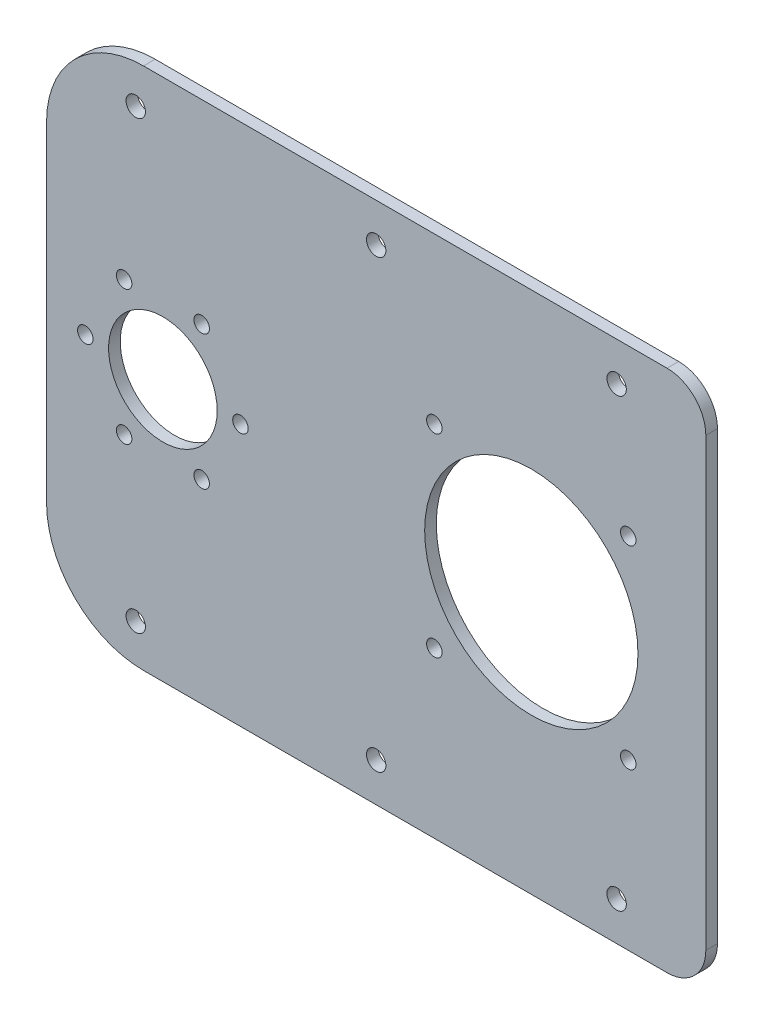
ISO-10303-21;
HEADER;
FILE_DESCRIPTION(('STEP AP214'),'2;1');
FILE_NAME('part.step','',(''),(''),'','','');
FILE_SCHEMA(('AUTOMOTIVE_DESIGN { 1 0 10303 214 1 1 1 1 }'));
ENDSEC;
DATA;
#1=APPLICATION_CONTEXT('core data for automotive mechanical design processes');
#2=APPLICATION_PROTOCOL_DEFINITION('international standard','automotive_design',2000,#1);
#3=PRODUCT_CONTEXT('',#1,'mechanical');
#4=PRODUCT('Part','Part','',(#3));
#5=PRODUCT_RELATED_PRODUCT_CATEGORY('part','',(#4));
#6=PRODUCT_DEFINITION_FORMATION('','',#4);
#7=PRODUCT_DEFINITION_CONTEXT('part definition',#1,'design');
#8=PRODUCT_DEFINITION('design','',#6,#7);
#9=PRODUCT_DEFINITION_SHAPE('','',#8);
#10=(LENGTH_UNIT() NAMED_UNIT(*) SI_UNIT(.MILLI.,.METRE.));
#11=(NAMED_UNIT(*) PLANE_ANGLE_UNIT() SI_UNIT($,.RADIAN.));
#12=(NAMED_UNIT(*) SI_UNIT($,.STERADIAN.) SOLID_ANGLE_UNIT());
#13=UNCERTAINTY_MEASURE_WITH_UNIT(LENGTH_MEASURE(1.E-05),#10,'distance_accuracy_value','');
#14=(GEOMETRIC_REPRESENTATION_CONTEXT(3) GLOBAL_UNCERTAINTY_ASSIGNED_CONTEXT((#13)) GLOBAL_UNIT_ASSIGNED_CONTEXT((#10,
#11,#12)) REPRESENTATION_CONTEXT('',''));
#15=CARTESIAN_POINT('',(0.,0.,0.));
#16=DIRECTION('',(0.,0.,1.));
#17=DIRECTION('',(1.,0.,0.));
#18=AXIS2_PLACEMENT_3D('',#15,#16,#17);
#19=CARTESIAN_POINT('',(0.,0.,1.5));
#20=DIRECTION('',(0.,0.,-1.));
#21=DIRECTION('',(-1.,0.,0.));
#22=AXIS2_PLACEMENT_3D('',#19,#20,#21);
#23=PLANE('',#22);
#24=CARTESIAN_POINT('',(62.,-57.5,1.5));
#25=DIRECTION('',(0.,0.,1.));
#26=DIRECTION('',(-1.,0.,0.));
#27=AXIS2_PLACEMENT_3D('',#24,#25,#26);
#28=CIRCLE('',#27,2.5);
#29=CARTESIAN_POINT('',(59.5,-57.5,1.5));
#30=VERTEX_POINT('',#29);
#31=EDGE_CURVE('E268',#30,#30,#28,.T.);
#32=ORIENTED_EDGE('',*,*,#31,.F.);
#33=EDGE_LOOP('',(#32));
#34=FACE_BOUND('',#33,.T.);
#35=CARTESIAN_POINT('',(-35.,0.,1.5));
#36=DIRECTION('',(0.,0.,1.));
#37=DIRECTION('',(1.,0.,0.));
#38=AXIS2_PLACEMENT_3D('',#35,#36,#37);
#39=CIRCLE('',#38,2.);
#40=CARTESIAN_POINT('',(-33.,0.,1.5));
#41=VERTEX_POINT('',#40);
#42=EDGE_CURVE('E262',#41,#41,#39,.T.);
#43=ORIENTED_EDGE('',*,*,#42,.F.);
#44=EDGE_LOOP('',(#43));
#45=FACE_BOUND('',#44,.T.);
#46=CARTESIAN_POINT('',(-45.,17.3205080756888,1.5));
#47=DIRECTION('',(0.,0.,1.));
#48=DIRECTION('',(1.,0.,0.));
#49=AXIS2_PLACEMENT_3D('',#46,#47,#48);
#50=CIRCLE('',#49,2.);
#51=CARTESIAN_POINT('',(-43.,17.3205080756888,1.5));
#52=VERTEX_POINT('',#51);
#53=EDGE_CURVE('E255',#52,#52,#50,.T.);
#54=ORIENTED_EDGE('',*,*,#53,.F.);
#55=EDGE_LOOP('',(#54));
#56=FACE_BOUND('',#55,.T.);
#57=CARTESIAN_POINT('',(-45.,-17.3205080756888,1.5));
#58=DIRECTION('',(0.,0.,1.));
#59=DIRECTION('',(1.,0.,0.));
#60=AXIS2_PLACEMENT_3D('',#57,#58,#59);
#61=CIRCLE('',#60,2.);
#62=CARTESIAN_POINT('',(-43.,-17.3205080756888,1.5));
#63=VERTEX_POINT('',#62);
#64=EDGE_CURVE('E285',#63,#63,#61,.T.);
#65=ORIENTED_EDGE('',*,*,#64,.F.);
#66=EDGE_LOOP('',(#65));
#67=FACE_BOUND('',#66,.T.);
#68=CARTESIAN_POINT('',(-65.0000000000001,-17.3205080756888,1.5));
#69=DIRECTION('',(0.,0.,1.));
#70=DIRECTION('',(1.,0.,0.));
#71=AXIS2_PLACEMENT_3D('',#68,#69,#70);
#72=CIRCLE('',#71,2.00000000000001);
#73=CARTESIAN_POINT('',(-63.0000000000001,-17.3205080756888,1.5));
#74=VERTEX_POINT('',#73);
#75=EDGE_CURVE('E279',#74,#74,#72,.T.);
#76=ORIENTED_EDGE('',*,*,#75,.F.);
#77=EDGE_LOOP('',(#76));
#78=FACE_BOUND('',#77,.T.);
#79=CARTESIAN_POINT('',(-64.9999999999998,17.3205080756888,1.5));
#80=DIRECTION('',(0.,0.,1.));
#81=DIRECTION('',(1.,0.,0.));
#82=AXIS2_PLACEMENT_3D('',#79,#80,#81);
#83=CIRCLE('',#82,2.);
#84=CARTESIAN_POINT('',(-62.9999999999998,17.3205080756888,1.5));
#85=VERTEX_POINT('',#84);
#86=EDGE_CURVE('E273',#85,#85,#83,.T.);
#87=ORIENTED_EDGE('',*,*,#86,.F.);
#88=EDGE_LOOP('',(#87));
#89=FACE_BOUND('',#88,.T.);
#90=CARTESIAN_POINT('',(0.,-57.5,1.5));
#91=DIRECTION('',(0.,0.,1.));
#92=DIRECTION('',(-1.,0.,0.));
#93=AXIS2_PLACEMENT_3D('',#90,#91,#92);
#94=CIRCLE('',#93,2.5);
#95=CARTESIAN_POINT('',(-2.49999999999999,-57.5,1.5));
#96=VERTEX_POINT('',#95);
#97=EDGE_CURVE('E225',#96,#96,#94,.T.);
#98=ORIENTED_EDGE('',*,*,#97,.F.);
#99=EDGE_LOOP('',(#98));
#100=FACE_BOUND('',#99,.T.);
#101=CARTESIAN_POINT('',(-62.,-57.5,1.5));
#102=DIRECTION('',(0.,0.,1.));
#103=DIRECTION('',(-1.,0.,0.));
#104=AXIS2_PLACEMENT_3D('',#101,#102,#103);
#105=CIRCLE('',#104,2.50000000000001);
#106=CARTESIAN_POINT('',(-64.5,-57.5,1.5));
#107=VERTEX_POINT('',#106);
#108=EDGE_CURVE('E232',#107,#107,#105,.T.);
#109=ORIENTED_EDGE('',*,*,#108,.F.);
#110=EDGE_LOOP('',(#109));
#111=FACE_BOUND('',#110,.T.);
#112=CARTESIAN_POINT('',(-75.,0.,1.5));
#113=DIRECTION('',(0.,0.,1.));
#114=DIRECTION('',(1.,0.,0.));
#115=AXIS2_PLACEMENT_3D('',#112,#113,#114);
#116=CIRCLE('',#115,2.);
#117=CARTESIAN_POINT('',(-73.,0.,1.5));
#118=VERTEX_POINT('',#117);
#119=EDGE_CURVE('E238',#118,#118,#116,.T.);
#120=ORIENTED_EDGE('',*,*,#119,.F.);
#121=EDGE_LOOP('',(#120));
#122=FACE_BOUND('',#121,.T.);
#123=CARTESIAN_POINT('',(-62.,57.5,1.5));
#124=DIRECTION('',(0.,0.,1.));
#125=DIRECTION('',(1.,0.,0.));
#126=AXIS2_PLACEMENT_3D('',#123,#124,#125);
#127=CIRCLE('',#126,2.5);
#128=CARTESIAN_POINT('',(-59.5,57.5,1.5));
#129=VERTEX_POINT('',#128);
#130=EDGE_CURVE('E244',#129,#129,#127,.T.);
#131=ORIENTED_EDGE('',*,*,#130,.F.);
#132=EDGE_LOOP('',(#131));
#133=FACE_BOUND('',#132,.T.);
#134=CARTESIAN_POINT('',(0.,57.5,1.5));
#135=DIRECTION('',(0.,0.,1.));
#136=DIRECTION('',(1.,0.,0.));
#137=AXIS2_PLACEMENT_3D('',#134,#135,#136);
#138=CIRCLE('',#137,2.5);
#139=CARTESIAN_POINT('',(2.5,57.5,1.5));
#140=VERTEX_POINT('',#139);
#141=EDGE_CURVE('E250',#140,#140,#138,.T.);
#142=ORIENTED_EDGE('',*,*,#141,.F.);
#143=EDGE_LOOP('',(#142));
#144=FACE_BOUND('',#143,.T.);
#145=CARTESIAN_POINT('',(62.,57.5,1.5));
#146=DIRECTION('',(0.,0.,1.));
#147=DIRECTION('',(1.,0.,0.));
#148=AXIS2_PLACEMENT_3D('',#145,#146,#147);
#149=CIRCLE('',#148,2.5);
#150=CARTESIAN_POINT('',(64.5,57.5,1.5));
#151=VERTEX_POINT('',#150);
#152=EDGE_CURVE('E219',#151,#151,#149,.T.);
#153=ORIENTED_EDGE('',*,*,#152,.F.);
#154=EDGE_LOOP('',(#153));
#155=FACE_BOUND('',#154,.T.);
#156=CARTESIAN_POINT('',(15.,25.,1.5));
#157=DIRECTION('',(0.,0.,1.));
#158=DIRECTION('',(1.,0.,0.));
#159=AXIS2_PLACEMENT_3D('',#156,#157,#158);
#160=CIRCLE('',#159,2.);
#161=CARTESIAN_POINT('',(17.,25.,1.5));
#162=VERTEX_POINT('',#161);
#163=EDGE_CURVE('E215',#162,#162,#160,.T.);
#164=ORIENTED_EDGE('',*,*,#163,.F.);
#165=EDGE_LOOP('',(#164));
#166=FACE_BOUND('',#165,.T.);
#167=CARTESIAN_POINT('',(65.,25.,1.5));
#168=DIRECTION('',(0.,0.,1.));
#169=DIRECTION('',(1.,0.,0.));
#170=AXIS2_PLACEMENT_3D('',#167,#168,#169);
#171=CIRCLE('',#170,2.);
#172=CARTESIAN_POINT('',(67.,25.,1.5));
#173=VERTEX_POINT('',#172);
#174=EDGE_CURVE('E209',#173,#173,#171,.T.);
#175=ORIENTED_EDGE('',*,*,#174,.F.);
#176=EDGE_LOOP('',(#175));
#177=FACE_BOUND('',#176,.T.);
#178=CARTESIAN_POINT('',(15.,-25.,1.5));
#179=DIRECTION('',(0.,0.,1.));
#180=DIRECTION('',(1.,0.,0.));
#181=AXIS2_PLACEMENT_3D('',#178,#179,#180);
#182=CIRCLE('',#181,2.);
#183=CARTESIAN_POINT('',(17.,-25.,1.5));
#184=VERTEX_POINT('',#183);
#185=EDGE_CURVE('E203',#184,#184,#182,.T.);
#186=ORIENTED_EDGE('',*,*,#185,.F.);
#187=EDGE_LOOP('',(#186));
#188=FACE_BOUND('',#187,.T.);
#189=CARTESIAN_POINT('',(65.,-25.,1.5));
#190=DIRECTION('',(0.,0.,1.));
#191=DIRECTION('',(1.,0.,0.));
#192=AXIS2_PLACEMENT_3D('',#189,#190,#191);
#193=CIRCLE('',#192,2.);
#194=CARTESIAN_POINT('',(67.,-25.,1.5));
#195=VERTEX_POINT('',#194);
#196=EDGE_CURVE('E197',#195,#195,#193,.T.);
#197=ORIENTED_EDGE('',*,*,#196,.F.);
#198=EDGE_LOOP('',(#197));
#199=FACE_BOUND('',#198,.T.);
#200=CARTESIAN_POINT('',(40.,0.,1.5));
#201=DIRECTION('',(0.,0.,1.));
#202=DIRECTION('',(1.,0.,0.));
#203=AXIS2_PLACEMENT_3D('',#200,#201,#202);
#204=CIRCLE('',#203,27.5);
#205=CARTESIAN_POINT('',(67.5,0.,1.5));
#206=VERTEX_POINT('',#205);
#207=EDGE_CURVE('E191',#206,#206,#204,.T.);
#208=ORIENTED_EDGE('',*,*,#207,.F.);
#209=EDGE_LOOP('',(#208));
#210=FACE_BOUND('',#209,.T.);
#211=DIRECTION('',(0.,-1.,0.));
#212=VECTOR('',#211,1.);
#213=CARTESIAN_POINT('',(-85.,-67.5,1.5));
#214=LINE('',#213,#212);
#215=CARTESIAN_POINT('',(-85.,42.5,1.5));
#216=VERTEX_POINT('',#215);
#217=CARTESIAN_POINT('',(-85.,-42.5,1.5));
#218=VERTEX_POINT('',#217);
#219=EDGE_CURVE('E166',#216,#218,#214,.T.);
#220=ORIENTED_EDGE('',*,*,#219,.T.);
#221=CARTESIAN_POINT('',(-60.,-42.5,1.5));
#222=DIRECTION('',(0.,0.,-1.));
#223=DIRECTION('',(-1.,0.,0.));
#224=AXIS2_PLACEMENT_3D('',#221,#222,#223);
#225=CIRCLE('',#224,25.);
#226=CARTESIAN_POINT('',(-60.,-67.5,1.5));
#227=VERTEX_POINT('',#226);
#228=EDGE_CURVE('E46',#218,#227,#225,.F.);
#229=ORIENTED_EDGE('',*,*,#228,.T.);
#230=DIRECTION('',(1.,0.,0.));
#231=VECTOR('',#230,1.);
#232=CARTESIAN_POINT('',(-85.,-67.5,1.5));
#233=LINE('',#232,#231);
#234=CARTESIAN_POINT('',(75.0000000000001,-67.5,1.5));
#235=VERTEX_POINT('',#234);
#236=EDGE_CURVE('E121',#227,#235,#233,.T.);
#237=ORIENTED_EDGE('',*,*,#236,.T.);
#238=CARTESIAN_POINT('',(75.,-57.5,1.5));
#239=DIRECTION('',(0.,0.,-1.));
#240=DIRECTION('',(-1.,0.,0.));
#241=AXIS2_PLACEMENT_3D('',#238,#239,#240);
#242=CIRCLE('',#241,10.);
#243=CARTESIAN_POINT('',(85.,-57.5,1.5));
#244=VERTEX_POINT('',#243);
#245=EDGE_CURVE('E144',#235,#244,#242,.F.);
#246=ORIENTED_EDGE('',*,*,#245,.T.);
#247=DIRECTION('',(0.,1.,0.));
#248=VECTOR('',#247,1.);
#249=CARTESIAN_POINT('',(85.,-67.5,1.5));
#250=LINE('',#249,#248);
#251=CARTESIAN_POINT('',(85.,57.5,1.5));
#252=VERTEX_POINT('',#251);
#253=EDGE_CURVE('E137',#244,#252,#250,.T.);
#254=ORIENTED_EDGE('',*,*,#253,.T.);
#255=CARTESIAN_POINT('',(75.0000000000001,57.5,1.5));
#256=DIRECTION('',(0.,0.,-1.));
#257=DIRECTION('',(-1.,0.,0.));
#258=AXIS2_PLACEMENT_3D('',#255,#256,#257);
#259=CIRCLE('',#258,10.);
#260=CARTESIAN_POINT('',(75.0000000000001,67.5,1.5));
#261=VERTEX_POINT('',#260);
#262=EDGE_CURVE('E146',#252,#261,#259,.F.);
#263=ORIENTED_EDGE('',*,*,#262,.T.);
#264=DIRECTION('',(-1.,0.,0.));
#265=VECTOR('',#264,1.);
#266=CARTESIAN_POINT('',(-85.,67.5,1.5));
#267=LINE('',#266,#265);
#268=CARTESIAN_POINT('',(-60.,67.5,1.5));
#269=VERTEX_POINT('',#268);
#270=EDGE_CURVE('E120',#261,#269,#267,.T.);
#271=ORIENTED_EDGE('',*,*,#270,.T.);
#272=CARTESIAN_POINT('',(-60.,42.5,1.5));
#273=DIRECTION('',(0.,0.,-1.));
#274=DIRECTION('',(-1.,0.,0.));
#275=AXIS2_PLACEMENT_3D('',#272,#273,#274);
#276=CIRCLE('',#275,25.);
#277=EDGE_CURVE('E161',#269,#216,#276,.F.);
#278=ORIENTED_EDGE('',*,*,#277,.T.);
#279=EDGE_LOOP('',(#220,#229,#237,#246,#254,#263,#271,#278));
#280=FACE_BOUND('',#279,.T.);
#281=CARTESIAN_POINT('',(-55.,0.,1.5));
#282=DIRECTION('',(0.,0.,1.));
#283=DIRECTION('',(1.,0.,0.));
#284=AXIS2_PLACEMENT_3D('',#281,#282,#283);
#285=CIRCLE('',#284,14.);
#286=CARTESIAN_POINT('',(-41.,0.,1.5));
#287=VERTEX_POINT('',#286);
#288=EDGE_CURVE('E133',#287,#287,#285,.T.);
#289=ORIENTED_EDGE('',*,*,#288,.F.);
#290=EDGE_LOOP('',(#289));
#291=FACE_BOUND('',#290,.T.);
#292=ADVANCED_FACE('F38',(#34,#45,#56,#67,#78,#89,#100,#111,#122,#133,#144,#155,#166,#177,#188,
#199,#210,#280,#291),#23,.F.);
#293=CARTESIAN_POINT('',(0.,0.,-1.5));
#294=DIRECTION('',(0.,0.,-1.));
#295=DIRECTION('',(-1.,0.,0.));
#296=AXIS2_PLACEMENT_3D('',#293,#294,#295);
#297=PLANE('',#296);
#298=CARTESIAN_POINT('',(62.,-57.5,-1.5));
#299=DIRECTION('',(0.,0.,1.));
#300=DIRECTION('',(-1.,0.,0.));
#301=AXIS2_PLACEMENT_3D('',#298,#299,#300);
#302=CIRCLE('',#301,2.5);
#303=CARTESIAN_POINT('',(59.5,-57.5,-1.5));
#304=VERTEX_POINT('',#303);
#305=EDGE_CURVE('E229',#304,#304,#302,.T.);
#306=ORIENTED_EDGE('',*,*,#305,.T.);
#307=EDGE_LOOP('',(#306));
#308=FACE_BOUND('',#307,.T.);
#309=CARTESIAN_POINT('',(-35.,0.,-1.5));
#310=DIRECTION('',(0.,0.,1.));
#311=DIRECTION('',(1.,0.,0.));
#312=AXIS2_PLACEMENT_3D('',#309,#310,#311);
#313=CIRCLE('',#312,2.);
#314=CARTESIAN_POINT('',(-33.,0.,-1.5));
#315=VERTEX_POINT('',#314);
#316=EDGE_CURVE('E265',#315,#315,#313,.T.);
#317=ORIENTED_EDGE('',*,*,#316,.T.);
#318=EDGE_LOOP('',(#317));
#319=FACE_BOUND('',#318,.T.);
#320=CARTESIAN_POINT('',(-45.,17.3205080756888,-1.5));
#321=DIRECTION('',(0.,0.,1.));
#322=DIRECTION('',(1.,0.,0.));
#323=AXIS2_PLACEMENT_3D('',#320,#321,#322);
#324=CIRCLE('',#323,2.);
#325=CARTESIAN_POINT('',(-43.,17.3205080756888,-1.5));
#326=VERTEX_POINT('',#325);
#327=EDGE_CURVE('E258',#326,#326,#324,.T.);
#328=ORIENTED_EDGE('',*,*,#327,.T.);
#329=EDGE_LOOP('',(#328));
#330=FACE_BOUND('',#329,.T.);
#331=CARTESIAN_POINT('',(-45.,-17.3205080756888,-1.5));
#332=DIRECTION('',(0.,0.,1.));
#333=DIRECTION('',(1.,0.,0.));
#334=AXIS2_PLACEMENT_3D('',#331,#332,#333);
#335=CIRCLE('',#334,2.);
#336=CARTESIAN_POINT('',(-43.,-17.3205080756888,-1.5));
#337=VERTEX_POINT('',#336);
#338=EDGE_CURVE('E259',#337,#337,#335,.T.);
#339=ORIENTED_EDGE('',*,*,#338,.T.);
#340=EDGE_LOOP('',(#339));
#341=FACE_BOUND('',#340,.T.);
#342=CARTESIAN_POINT('',(-65.0000000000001,-17.3205080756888,-1.5));
#343=DIRECTION('',(0.,0.,1.));
#344=DIRECTION('',(1.,0.,0.));
#345=AXIS2_PLACEMENT_3D('',#342,#343,#344);
#346=CIRCLE('',#345,2.00000000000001);
#347=CARTESIAN_POINT('',(-63.0000000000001,-17.3205080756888,-1.5));
#348=VERTEX_POINT('',#347);
#349=EDGE_CURVE('E282',#348,#348,#346,.T.);
#350=ORIENTED_EDGE('',*,*,#349,.T.);
#351=EDGE_LOOP('',(#350));
#352=FACE_BOUND('',#351,.T.);
#353=CARTESIAN_POINT('',(-64.9999999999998,17.3205080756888,-1.5));
#354=DIRECTION('',(0.,0.,1.));
#355=DIRECTION('',(1.,0.,0.));
#356=AXIS2_PLACEMENT_3D('',#353,#354,#355);
#357=CIRCLE('',#356,2.);
#358=CARTESIAN_POINT('',(-62.9999999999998,17.3205080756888,-1.5));
#359=VERTEX_POINT('',#358);
#360=EDGE_CURVE('E276',#359,#359,#357,.T.);
#361=ORIENTED_EDGE('',*,*,#360,.T.);
#362=EDGE_LOOP('',(#361));
#363=FACE_BOUND('',#362,.T.);
#364=CARTESIAN_POINT('',(0.,-57.5,-1.5));
#365=DIRECTION('',(0.,0.,1.));
#366=DIRECTION('',(-1.,0.,0.));
#367=AXIS2_PLACEMENT_3D('',#364,#365,#366);
#368=CIRCLE('',#367,2.5);
#369=CARTESIAN_POINT('',(-2.49999999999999,-57.5,-1.5));
#370=VERTEX_POINT('',#369);
#371=EDGE_CURVE('E228',#370,#370,#368,.T.);
#372=ORIENTED_EDGE('',*,*,#371,.T.);
#373=EDGE_LOOP('',(#372));
#374=FACE_BOUND('',#373,.T.);
#375=CARTESIAN_POINT('',(-62.,-57.5,-1.5));
#376=DIRECTION('',(0.,0.,1.));
#377=DIRECTION('',(-1.,0.,0.));
#378=AXIS2_PLACEMENT_3D('',#375,#376,#377);
#379=CIRCLE('',#378,2.50000000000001);
#380=CARTESIAN_POINT('',(-64.5,-57.5,-1.5));
#381=VERTEX_POINT('',#380);
#382=EDGE_CURVE('E235',#381,#381,#379,.T.);
#383=ORIENTED_EDGE('',*,*,#382,.T.);
#384=EDGE_LOOP('',(#383));
#385=FACE_BOUND('',#384,.T.);
#386=CARTESIAN_POINT('',(-75.,0.,-1.5));
#387=DIRECTION('',(0.,0.,1.));
#388=DIRECTION('',(1.,0.,0.));
#389=AXIS2_PLACEMENT_3D('',#386,#387,#388);
#390=CIRCLE('',#389,2.);
#391=CARTESIAN_POINT('',(-73.,0.,-1.5));
#392=VERTEX_POINT('',#391);
#393=EDGE_CURVE('E241',#392,#392,#390,.T.);
#394=ORIENTED_EDGE('',*,*,#393,.T.);
#395=EDGE_LOOP('',(#394));
#396=FACE_BOUND('',#395,.T.);
#397=CARTESIAN_POINT('',(-62.,57.5,-1.5));
#398=DIRECTION('',(0.,0.,1.));
#399=DIRECTION('',(1.,0.,0.));
#400=AXIS2_PLACEMENT_3D('',#397,#398,#399);
#401=CIRCLE('',#400,2.5);
#402=CARTESIAN_POINT('',(-59.5,57.5,-1.5));
#403=VERTEX_POINT('',#402);
#404=EDGE_CURVE('E247',#403,#403,#401,.T.);
#405=ORIENTED_EDGE('',*,*,#404,.T.);
#406=EDGE_LOOP('',(#405));
#407=FACE_BOUND('',#406,.T.);
#408=CARTESIAN_POINT('',(0.,57.5,-1.5));
#409=DIRECTION('',(0.,0.,1.));
#410=DIRECTION('',(1.,0.,0.));
#411=AXIS2_PLACEMENT_3D('',#408,#409,#410);
#412=CIRCLE('',#411,2.5);
#413=CARTESIAN_POINT('',(2.5,57.5,-1.5));
#414=VERTEX_POINT('',#413);
#415=EDGE_CURVE('E222',#414,#414,#412,.T.);
#416=ORIENTED_EDGE('',*,*,#415,.T.);
#417=EDGE_LOOP('',(#416));
#418=FACE_BOUND('',#417,.T.);
#419=CARTESIAN_POINT('',(62.,57.5,-1.5));
#420=DIRECTION('',(0.,0.,1.));
#421=DIRECTION('',(1.,0.,0.));
#422=AXIS2_PLACEMENT_3D('',#419,#420,#421);
#423=CIRCLE('',#422,2.5);
#424=CARTESIAN_POINT('',(64.5,57.5,-1.5));
#425=VERTEX_POINT('',#424);
#426=EDGE_CURVE('E218',#425,#425,#423,.T.);
#427=ORIENTED_EDGE('',*,*,#426,.T.);
#428=EDGE_LOOP('',(#427));
#429=FACE_BOUND('',#428,.T.);
#430=CARTESIAN_POINT('',(15.,25.,-1.5));
#431=DIRECTION('',(0.,0.,-1.));
#432=DIRECTION('',(-1.,0.,0.));
#433=AXIS2_PLACEMENT_3D('',#430,#431,#432);
#434=CIRCLE('',#433,2.);
#435=CARTESIAN_POINT('',(13.,25.,-1.5));
#436=VERTEX_POINT('',#435);
#437=EDGE_CURVE('E212',#436,#436,#434,.T.);
#438=ORIENTED_EDGE('',*,*,#437,.F.);
#439=EDGE_LOOP('',(#438));
#440=FACE_BOUND('',#439,.T.);
#441=CARTESIAN_POINT('',(65.,25.,-1.5));
#442=DIRECTION('',(0.,0.,-1.));
#443=DIRECTION('',(-1.,0.,0.));
#444=AXIS2_PLACEMENT_3D('',#441,#442,#443);
#445=CIRCLE('',#444,2.);
#446=CARTESIAN_POINT('',(63.,25.,-1.5));
#447=VERTEX_POINT('',#446);
#448=EDGE_CURVE('E206',#447,#447,#445,.T.);
#449=ORIENTED_EDGE('',*,*,#448,.F.);
#450=EDGE_LOOP('',(#449));
#451=FACE_BOUND('',#450,.T.);
#452=CARTESIAN_POINT('',(15.,-25.,-1.5));
#453=DIRECTION('',(0.,0.,-1.));
#454=DIRECTION('',(-1.,0.,0.));
#455=AXIS2_PLACEMENT_3D('',#452,#453,#454);
#456=CIRCLE('',#455,2.);
#457=CARTESIAN_POINT('',(13.,-25.,-1.5));
#458=VERTEX_POINT('',#457);
#459=EDGE_CURVE('E200',#458,#458,#456,.T.);
#460=ORIENTED_EDGE('',*,*,#459,.F.);
#461=EDGE_LOOP('',(#460));
#462=FACE_BOUND('',#461,.T.);
#463=CARTESIAN_POINT('',(65.,-25.,-1.5));
#464=DIRECTION('',(0.,0.,-1.));
#465=DIRECTION('',(-1.,0.,0.));
#466=AXIS2_PLACEMENT_3D('',#463,#464,#465);
#467=CIRCLE('',#466,2.);
#468=CARTESIAN_POINT('',(63.,-25.,-1.5));
#469=VERTEX_POINT('',#468);
#470=EDGE_CURVE('E194',#469,#469,#467,.T.);
#471=ORIENTED_EDGE('',*,*,#470,.F.);
#472=EDGE_LOOP('',(#471));
#473=FACE_BOUND('',#472,.T.);
#474=CARTESIAN_POINT('',(40.,0.,-1.5));
#475=DIRECTION('',(0.,0.,1.));
#476=DIRECTION('',(1.,0.,0.));
#477=AXIS2_PLACEMENT_3D('',#474,#475,#476);
#478=CIRCLE('',#477,27.5);
#479=CARTESIAN_POINT('',(67.5,0.,-1.5));
#480=VERTEX_POINT('',#479);
#481=EDGE_CURVE('E186',#480,#480,#478,.T.);
#482=ORIENTED_EDGE('',*,*,#481,.T.);
#483=EDGE_LOOP('',(#482));
#484=FACE_BOUND('',#483,.T.);
#485=DIRECTION('',(1.,0.,0.));
#486=VECTOR('',#485,1.);
#487=CARTESIAN_POINT('',(-85.,-67.5,-1.5));
#488=LINE('',#487,#486);
#489=CARTESIAN_POINT('',(-60.,-67.5,-1.5));
#490=VERTEX_POINT('',#489);
#491=CARTESIAN_POINT('',(75.0000000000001,-67.5,-1.5));
#492=VERTEX_POINT('',#491);
#493=EDGE_CURVE('E131',#490,#492,#488,.T.);
#494=ORIENTED_EDGE('',*,*,#493,.F.);
#495=CARTESIAN_POINT('',(-60.,-42.5,-1.5));
#496=DIRECTION('',(0.,0.,-1.));
#497=DIRECTION('',(-1.,0.,0.));
#498=AXIS2_PLACEMENT_3D('',#495,#496,#497);
#499=CIRCLE('',#498,25.);
#500=CARTESIAN_POINT('',(-85.,-42.5,-1.5));
#501=VERTEX_POINT('',#500);
#502=EDGE_CURVE('E155',#490,#501,#499,.T.);
#503=ORIENTED_EDGE('',*,*,#502,.T.);
#504=DIRECTION('',(0.,-1.,0.));
#505=VECTOR('',#504,1.);
#506=CARTESIAN_POINT('',(-85.,-67.5,-1.5));
#507=LINE('',#506,#505);
#508=CARTESIAN_POINT('',(-85.,42.5,-1.5));
#509=VERTEX_POINT('',#508);
#510=EDGE_CURVE('E128',#509,#501,#507,.T.);
#511=ORIENTED_EDGE('',*,*,#510,.F.);
#512=CARTESIAN_POINT('',(-60.,42.5,-1.5));
#513=DIRECTION('',(0.,0.,-1.));
#514=DIRECTION('',(-1.,0.,0.));
#515=AXIS2_PLACEMENT_3D('',#512,#513,#514);
#516=CIRCLE('',#515,25.);
#517=CARTESIAN_POINT('',(-60.,67.5,-1.5));
#518=VERTEX_POINT('',#517);
#519=EDGE_CURVE('E127',#509,#518,#516,.T.);
#520=ORIENTED_EDGE('',*,*,#519,.T.);
#521=DIRECTION('',(-1.,0.,0.));
#522=VECTOR('',#521,1.);
#523=CARTESIAN_POINT('',(-85.,67.5,-1.5));
#524=LINE('',#523,#522);
#525=CARTESIAN_POINT('',(75.0000000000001,67.5,-1.5));
#526=VERTEX_POINT('',#525);
#527=EDGE_CURVE('E119',#526,#518,#524,.T.);
#528=ORIENTED_EDGE('',*,*,#527,.F.);
#529=CARTESIAN_POINT('',(75.0000000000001,57.5,-1.5));
#530=DIRECTION('',(0.,0.,-1.));
#531=DIRECTION('',(-1.,0.,0.));
#532=AXIS2_PLACEMENT_3D('',#529,#530,#531);
#533=CIRCLE('',#532,10.);
#534=CARTESIAN_POINT('',(85.,57.5,-1.5));
#535=VERTEX_POINT('',#534);
#536=EDGE_CURVE('E105',#526,#535,#533,.T.);
#537=ORIENTED_EDGE('',*,*,#536,.T.);
#538=DIRECTION('',(0.,1.,0.));
#539=VECTOR('',#538,1.);
#540=CARTESIAN_POINT('',(85.,-67.5,-1.5));
#541=LINE('',#540,#539);
#542=CARTESIAN_POINT('',(85.,-57.5,-1.5));
#543=VERTEX_POINT('',#542);
#544=EDGE_CURVE('E129',#543,#535,#541,.T.);
#545=ORIENTED_EDGE('',*,*,#544,.F.);
#546=CARTESIAN_POINT('',(75.,-57.5,-1.5));
#547=DIRECTION('',(0.,0.,-1.));
#548=DIRECTION('',(-1.,0.,0.));
#549=AXIS2_PLACEMENT_3D('',#546,#547,#548);
#550=CIRCLE('',#549,10.);
#551=EDGE_CURVE('E116',#543,#492,#550,.T.);
#552=ORIENTED_EDGE('',*,*,#551,.T.);
#553=EDGE_LOOP('',(#494,#503,#511,#520,#528,#537,#545,#552));
#554=FACE_BOUND('',#553,.T.);
#555=CARTESIAN_POINT('',(-55.,0.,-1.5));
#556=DIRECTION('',(0.,0.,1.));
#557=DIRECTION('',(1.,0.,0.));
#558=AXIS2_PLACEMENT_3D('',#555,#556,#557);
#559=CIRCLE('',#558,14.);
#560=CARTESIAN_POINT('',(-41.,0.,-1.5));
#561=VERTEX_POINT('',#560);
#562=EDGE_CURVE('E183',#561,#561,#559,.T.);
#563=ORIENTED_EDGE('',*,*,#562,.T.);
#564=EDGE_LOOP('',(#563));
#565=FACE_BOUND('',#564,.T.);
#566=ADVANCED_FACE('F124',(#308,#319,#330,#341,#352,#363,#374,#385,#396,#407,#418,#429,#440,
#451,#462,#473,#484,#554,#565),#297,.T.);
#567=CARTESIAN_POINT('',(85.,-67.5,1.5));
#568=DIRECTION('',(-1.,0.,0.));
#569=DIRECTION('',(0.,0.,1.));
#570=AXIS2_PLACEMENT_3D('',#567,#568,#569);
#571=PLANE('',#570);
#572=ORIENTED_EDGE('',*,*,#544,.T.);
#573=DIRECTION('',(0.,0.,-1.));
#574=VECTOR('',#573,1.);
#575=CARTESIAN_POINT('',(85.,57.5,1.5));
#576=LINE('',#575,#574);
#577=EDGE_CURVE('E110',#535,#252,#576,.F.);
#578=ORIENTED_EDGE('',*,*,#577,.T.);
#579=ORIENTED_EDGE('',*,*,#253,.F.);
#580=DIRECTION('',(0.,0.,-1.));
#581=VECTOR('',#580,1.);
#582=CARTESIAN_POINT('',(85.,-57.5,1.5));
#583=LINE('',#582,#581);
#584=EDGE_CURVE('E115',#244,#543,#583,.T.);
#585=ORIENTED_EDGE('',*,*,#584,.T.);
#586=EDGE_LOOP('',(#572,#578,#579,#585));
#587=FACE_BOUND('',#586,.T.);
#588=ADVANCED_FACE('F351',(#587),#571,.F.);
#589=CARTESIAN_POINT('',(-85.,67.5,1.5));
#590=DIRECTION('',(0.,-1.,0.));
#591=DIRECTION('',(0.,0.,-1.));
#592=AXIS2_PLACEMENT_3D('',#589,#590,#591);
#593=PLANE('',#592);
#594=ORIENTED_EDGE('',*,*,#527,.T.);
#595=DIRECTION('',(0.,0.,-1.));
#596=VECTOR('',#595,1.);
#597=CARTESIAN_POINT('',(-60.,67.5,1.5));
#598=LINE('',#597,#596);
#599=EDGE_CURVE('E11',#518,#269,#598,.F.);
#600=ORIENTED_EDGE('',*,*,#599,.T.);
#601=ORIENTED_EDGE('',*,*,#270,.F.);
#602=DIRECTION('',(0.,0.,-1.));
#603=VECTOR('',#602,1.);
#604=CARTESIAN_POINT('',(75.0000000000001,67.5,1.5));
#605=LINE('',#604,#603);
#606=EDGE_CURVE('E109',#261,#526,#605,.T.);
#607=ORIENTED_EDGE('',*,*,#606,.T.);
#608=EDGE_LOOP('',(#594,#600,#601,#607));
#609=FACE_BOUND('',#608,.T.);
#610=ADVANCED_FACE('F118',(#609),#593,.F.);
#611=CARTESIAN_POINT('',(-85.,-67.5,1.5));
#612=DIRECTION('',(1.,0.,0.));
#613=DIRECTION('',(0.,0.,-1.));
#614=AXIS2_PLACEMENT_3D('',#611,#612,#613);
#615=PLANE('',#614);
#616=ORIENTED_EDGE('',*,*,#510,.T.);
#617=DIRECTION('',(0.,0.,-1.));
#618=VECTOR('',#617,1.);
#619=CARTESIAN_POINT('',(-85.,-42.5,1.5));
#620=LINE('',#619,#618);
#621=EDGE_CURVE('E59',#501,#218,#620,.F.);
#622=ORIENTED_EDGE('',*,*,#621,.T.);
#623=ORIENTED_EDGE('',*,*,#219,.F.);
#624=DIRECTION('',(0.,0.,-1.));
#625=VECTOR('',#624,1.);
#626=CARTESIAN_POINT('',(-85.,42.5,1.5));
#627=LINE('',#626,#625);
#628=EDGE_CURVE('E157',#216,#509,#627,.T.);
#629=ORIENTED_EDGE('',*,*,#628,.T.);
#630=EDGE_LOOP('',(#616,#622,#623,#629));
#631=FACE_BOUND('',#630,.T.);
#632=ADVANCED_FACE('F174',(#631),#615,.F.);
#633=CARTESIAN_POINT('',(-85.,-67.5,1.5));
#634=DIRECTION('',(0.,1.,0.));
#635=DIRECTION('',(0.,0.,1.));
#636=AXIS2_PLACEMENT_3D('',#633,#634,#635);
#637=PLANE('',#636);
#638=ORIENTED_EDGE('',*,*,#236,.F.);
#639=DIRECTION('',(0.,0.,-1.));
#640=VECTOR('',#639,1.);
#641=CARTESIAN_POINT('',(-60.,-67.5,1.5));
#642=LINE('',#641,#640);
#643=EDGE_CURVE('E151',#227,#490,#642,.T.);
#644=ORIENTED_EDGE('',*,*,#643,.T.);
#645=ORIENTED_EDGE('',*,*,#493,.T.);
#646=DIRECTION('',(0.,0.,-1.));
#647=VECTOR('',#646,1.);
#648=CARTESIAN_POINT('',(75.0000000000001,-67.5,1.5));
#649=LINE('',#648,#647);
#650=EDGE_CURVE('E148',#492,#235,#649,.F.);
#651=ORIENTED_EDGE('',*,*,#650,.T.);
#652=EDGE_LOOP('',(#638,#644,#645,#651));
#653=FACE_BOUND('',#652,.T.);
#654=ADVANCED_FACE('F170',(#653),#637,.F.);
#655=CARTESIAN_POINT('',(-55.,0.,1.5));
#656=DIRECTION('',(0.,0.,-1.));
#657=DIRECTION('',(-1.,0.,0.));
#658=AXIS2_PLACEMENT_3D('',#655,#656,#657);
#659=CYLINDRICAL_SURFACE('',#658,14.);
#660=ORIENTED_EDGE('',*,*,#288,.T.);
#661=EDGE_LOOP('',(#660));
#662=FACE_BOUND('',#661,.T.);
#663=ORIENTED_EDGE('',*,*,#562,.F.);
#664=EDGE_LOOP('',(#663));
#665=FACE_BOUND('',#664,.T.);
#666=ADVANCED_FACE('F334',(#662,#665),#659,.F.);
#667=CARTESIAN_POINT('',(40.,0.,-1.5));
#668=DIRECTION('',(0.,0.,1.));
#669=DIRECTION('',(1.,0.,0.));
#670=AXIS2_PLACEMENT_3D('',#667,#668,#669);
#671=CYLINDRICAL_SURFACE('',#670,27.5);
#672=ORIENTED_EDGE('',*,*,#481,.F.);
#673=EDGE_LOOP('',(#672));
#674=FACE_BOUND('',#673,.T.);
#675=ORIENTED_EDGE('',*,*,#207,.T.);
#676=EDGE_LOOP('',(#675));
#677=FACE_BOUND('',#676,.T.);
#678=ADVANCED_FACE('F331',(#674,#677),#671,.F.);
#679=CARTESIAN_POINT('',(65.,-25.,1.5));
#680=DIRECTION('',(0.,0.,1.));
#681=DIRECTION('',(1.,0.,0.));
#682=AXIS2_PLACEMENT_3D('',#679,#680,#681);
#683=CYLINDRICAL_SURFACE('',#682,2.);
#684=ORIENTED_EDGE('',*,*,#470,.T.);
#685=EDGE_LOOP('',(#684));
#686=FACE_BOUND('',#685,.T.);
#687=ORIENTED_EDGE('',*,*,#196,.T.);
#688=EDGE_LOOP('',(#687));
#689=FACE_BOUND('',#688,.T.);
#690=ADVANCED_FACE('F333',(#686,#689),#683,.F.);
#691=CARTESIAN_POINT('',(15.,-25.,1.5));
#692=DIRECTION('',(0.,0.,1.));
#693=DIRECTION('',(1.,0.,0.));
#694=AXIS2_PLACEMENT_3D('',#691,#692,#693);
#695=CYLINDRICAL_SURFACE('',#694,2.);
#696=ORIENTED_EDGE('',*,*,#459,.T.);
#697=EDGE_LOOP('',(#696));
#698=FACE_BOUND('',#697,.T.);
#699=ORIENTED_EDGE('',*,*,#185,.T.);
#700=EDGE_LOOP('',(#699));
#701=FACE_BOUND('',#700,.T.);
#702=ADVANCED_FACE('F341',(#698,#701),#695,.F.);
#703=CARTESIAN_POINT('',(65.,25.,1.5));
#704=DIRECTION('',(0.,0.,1.));
#705=DIRECTION('',(1.,0.,0.));
#706=AXIS2_PLACEMENT_3D('',#703,#704,#705);
#707=CYLINDRICAL_SURFACE('',#706,2.);
#708=ORIENTED_EDGE('',*,*,#448,.T.);
#709=EDGE_LOOP('',(#708));
#710=FACE_BOUND('',#709,.T.);
#711=ORIENTED_EDGE('',*,*,#174,.T.);
#712=EDGE_LOOP('',(#711));
#713=FACE_BOUND('',#712,.T.);
#714=ADVANCED_FACE('F551',(#710,#713),#707,.F.);
#715=CARTESIAN_POINT('',(15.,25.,1.5));
#716=DIRECTION('',(0.,0.,1.));
#717=DIRECTION('',(1.,0.,0.));
#718=AXIS2_PLACEMENT_3D('',#715,#716,#717);
#719=CYLINDRICAL_SURFACE('',#718,2.);
#720=ORIENTED_EDGE('',*,*,#437,.T.);
#721=EDGE_LOOP('',(#720));
#722=FACE_BOUND('',#721,.T.);
#723=ORIENTED_EDGE('',*,*,#163,.T.);
#724=EDGE_LOOP('',(#723));
#725=FACE_BOUND('',#724,.T.);
#726=ADVANCED_FACE('F540',(#722,#725),#719,.F.);
#727=CARTESIAN_POINT('',(62.,57.5,-1.5));
#728=DIRECTION('',(0.,0.,1.));
#729=DIRECTION('',(1.,0.,0.));
#730=AXIS2_PLACEMENT_3D('',#727,#728,#729);
#731=CYLINDRICAL_SURFACE('',#730,2.5);
#732=ORIENTED_EDGE('',*,*,#426,.F.);
#733=EDGE_LOOP('',(#732));
#734=FACE_BOUND('',#733,.T.);
#735=ORIENTED_EDGE('',*,*,#152,.T.);
#736=EDGE_LOOP('',(#735));
#737=FACE_BOUND('',#736,.T.);
#738=ADVANCED_FACE('F530',(#734,#737),#731,.F.);
#739=CARTESIAN_POINT('',(0.,57.5,-1.5));
#740=DIRECTION('',(0.,0.,1.));
#741=DIRECTION('',(1.,0.,0.));
#742=AXIS2_PLACEMENT_3D('',#739,#740,#741);
#743=CYLINDRICAL_SURFACE('',#742,2.5);
#744=ORIENTED_EDGE('',*,*,#415,.F.);
#745=EDGE_LOOP('',(#744));
#746=FACE_BOUND('',#745,.T.);
#747=ORIENTED_EDGE('',*,*,#141,.T.);
#748=EDGE_LOOP('',(#747));
#749=FACE_BOUND('',#748,.T.);
#750=ADVANCED_FACE('F520',(#746,#749),#743,.F.);
#751=CARTESIAN_POINT('',(-62.,57.5,-1.5));
#752=DIRECTION('',(0.,0.,1.));
#753=DIRECTION('',(1.,0.,0.));
#754=AXIS2_PLACEMENT_3D('',#751,#752,#753);
#755=CYLINDRICAL_SURFACE('',#754,2.5);
#756=ORIENTED_EDGE('',*,*,#404,.F.);
#757=EDGE_LOOP('',(#756));
#758=FACE_BOUND('',#757,.T.);
#759=ORIENTED_EDGE('',*,*,#130,.T.);
#760=EDGE_LOOP('',(#759));
#761=FACE_BOUND('',#760,.T.);
#762=ADVANCED_FACE('F510',(#758,#761),#755,.F.);
#763=CARTESIAN_POINT('',(-75.,0.,-1.5));
#764=DIRECTION('',(0.,0.,1.));
#765=DIRECTION('',(1.,0.,0.));
#766=AXIS2_PLACEMENT_3D('',#763,#764,#765);
#767=CYLINDRICAL_SURFACE('',#766,2.);
#768=ORIENTED_EDGE('',*,*,#393,.F.);
#769=EDGE_LOOP('',(#768));
#770=FACE_BOUND('',#769,.T.);
#771=ORIENTED_EDGE('',*,*,#119,.T.);
#772=EDGE_LOOP('',(#771));
#773=FACE_BOUND('',#772,.T.);
#774=ADVANCED_FACE('F500',(#770,#773),#767,.F.);
#775=CARTESIAN_POINT('',(-62.,-57.5,-1.5));
#776=DIRECTION('',(0.,0.,1.));
#777=DIRECTION('',(1.,0.,0.));
#778=AXIS2_PLACEMENT_3D('',#775,#776,#777);
#779=CYLINDRICAL_SURFACE('',#778,2.50000000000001);
#780=ORIENTED_EDGE('',*,*,#382,.F.);
#781=EDGE_LOOP('',(#780));
#782=FACE_BOUND('',#781,.T.);
#783=ORIENTED_EDGE('',*,*,#108,.T.);
#784=EDGE_LOOP('',(#783));
#785=FACE_BOUND('',#784,.T.);
#786=ADVANCED_FACE('F490',(#782,#785),#779,.F.);
#787=CARTESIAN_POINT('',(0.,-57.5,-1.5));
#788=DIRECTION('',(0.,0.,1.));
#789=DIRECTION('',(1.,0.,0.));
#790=AXIS2_PLACEMENT_3D('',#787,#788,#789);
#791=CYLINDRICAL_SURFACE('',#790,2.5);
#792=ORIENTED_EDGE('',*,*,#371,.F.);
#793=EDGE_LOOP('',(#792));
#794=FACE_BOUND('',#793,.T.);
#795=ORIENTED_EDGE('',*,*,#97,.T.);
#796=EDGE_LOOP('',(#795));
#797=FACE_BOUND('',#796,.T.);
#798=ADVANCED_FACE('F480',(#794,#797),#791,.F.);
#799=CARTESIAN_POINT('',(-64.9999999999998,17.3205080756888,-1.5));
#800=DIRECTION('',(0.,0.,1.));
#801=DIRECTION('',(1.,0.,0.));
#802=AXIS2_PLACEMENT_3D('',#799,#800,#801);
#803=CYLINDRICAL_SURFACE('',#802,2.);
#804=ORIENTED_EDGE('',*,*,#360,.F.);
#805=EDGE_LOOP('',(#804));
#806=FACE_BOUND('',#805,.T.);
#807=ORIENTED_EDGE('',*,*,#86,.T.);
#808=EDGE_LOOP('',(#807));
#809=FACE_BOUND('',#808,.T.);
#810=ADVANCED_FACE('F470',(#806,#809),#803,.F.);
#811=CARTESIAN_POINT('',(-65.0000000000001,-17.3205080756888,-1.5));
#812=DIRECTION('',(0.,0.,1.));
#813=DIRECTION('',(1.,0.,0.));
#814=AXIS2_PLACEMENT_3D('',#811,#812,#813);
#815=CYLINDRICAL_SURFACE('',#814,2.00000000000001);
#816=ORIENTED_EDGE('',*,*,#349,.F.);
#817=EDGE_LOOP('',(#816));
#818=FACE_BOUND('',#817,.T.);
#819=ORIENTED_EDGE('',*,*,#75,.T.);
#820=EDGE_LOOP('',(#819));
#821=FACE_BOUND('',#820,.T.);
#822=ADVANCED_FACE('F297',(#818,#821),#815,.F.);
#823=CARTESIAN_POINT('',(-45.,-17.3205080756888,-1.5));
#824=DIRECTION('',(0.,0.,1.));
#825=DIRECTION('',(1.,0.,0.));
#826=AXIS2_PLACEMENT_3D('',#823,#824,#825);
#827=CYLINDRICAL_SURFACE('',#826,2.);
#828=ORIENTED_EDGE('',*,*,#338,.F.);
#829=EDGE_LOOP('',(#828));
#830=FACE_BOUND('',#829,.T.);
#831=ORIENTED_EDGE('',*,*,#64,.T.);
#832=EDGE_LOOP('',(#831));
#833=FACE_BOUND('',#832,.T.);
#834=ADVANCED_FACE('F293',(#830,#833),#827,.F.);
#835=CARTESIAN_POINT('',(-45.,17.3205080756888,-1.5));
#836=DIRECTION('',(0.,0.,1.));
#837=DIRECTION('',(1.,0.,0.));
#838=AXIS2_PLACEMENT_3D('',#835,#836,#837);
#839=CYLINDRICAL_SURFACE('',#838,2.);
#840=ORIENTED_EDGE('',*,*,#327,.F.);
#841=EDGE_LOOP('',(#840));
#842=FACE_BOUND('',#841,.T.);
#843=ORIENTED_EDGE('',*,*,#53,.T.);
#844=EDGE_LOOP('',(#843));
#845=FACE_BOUND('',#844,.T.);
#846=ADVANCED_FACE('F296',(#842,#845),#839,.F.);
#847=CARTESIAN_POINT('',(-35.,0.,-1.5));
#848=DIRECTION('',(0.,0.,1.));
#849=DIRECTION('',(1.,0.,0.));
#850=AXIS2_PLACEMENT_3D('',#847,#848,#849);
#851=CYLINDRICAL_SURFACE('',#850,2.);
#852=ORIENTED_EDGE('',*,*,#316,.F.);
#853=EDGE_LOOP('',(#852));
#854=FACE_BOUND('',#853,.T.);
#855=ORIENTED_EDGE('',*,*,#42,.T.);
#856=EDGE_LOOP('',(#855));
#857=FACE_BOUND('',#856,.T.);
#858=ADVANCED_FACE('F436',(#854,#857),#851,.F.);
#859=CARTESIAN_POINT('',(62.,-57.5,-1.5));
#860=DIRECTION('',(0.,0.,1.));
#861=DIRECTION('',(1.,0.,0.));
#862=AXIS2_PLACEMENT_3D('',#859,#860,#861);
#863=CYLINDRICAL_SURFACE('',#862,2.5);
#864=ORIENTED_EDGE('',*,*,#305,.F.);
#865=EDGE_LOOP('',(#864));
#866=FACE_BOUND('',#865,.T.);
#867=ORIENTED_EDGE('',*,*,#31,.T.);
#868=EDGE_LOOP('',(#867));
#869=FACE_BOUND('',#868,.T.);
#870=ADVANCED_FACE('F365',(#866,#869),#863,.F.);
#871=CARTESIAN_POINT('',(75.0000000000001,57.5,1.5));
#872=DIRECTION('',(0.,0.,-1.));
#873=DIRECTION('',(-1.,0.,0.));
#874=AXIS2_PLACEMENT_3D('',#871,#872,#873);
#875=CYLINDRICAL_SURFACE('',#874,10.);
#876=ORIENTED_EDGE('',*,*,#262,.F.);
#877=ORIENTED_EDGE('',*,*,#577,.F.);
#878=ORIENTED_EDGE('',*,*,#536,.F.);
#879=ORIENTED_EDGE('',*,*,#606,.F.);
#880=EDGE_LOOP('',(#876,#877,#878,#879));
#881=FACE_BOUND('',#880,.T.);
#882=ADVANCED_FACE('F108',(#881),#875,.T.);
#883=CARTESIAN_POINT('',(75.,-57.5,1.5));
#884=DIRECTION('',(0.,0.,-1.));
#885=DIRECTION('',(-1.,0.,0.));
#886=AXIS2_PLACEMENT_3D('',#883,#884,#885);
#887=CYLINDRICAL_SURFACE('',#886,10.);
#888=ORIENTED_EDGE('',*,*,#245,.F.);
#889=ORIENTED_EDGE('',*,*,#650,.F.);
#890=ORIENTED_EDGE('',*,*,#551,.F.);
#891=ORIENTED_EDGE('',*,*,#584,.F.);
#892=EDGE_LOOP('',(#888,#889,#890,#891));
#893=FACE_BOUND('',#892,.T.);
#894=ADVANCED_FACE('F364',(#893),#887,.T.);
#895=CARTESIAN_POINT('',(-60.,-42.5,1.5));
#896=DIRECTION('',(0.,0.,-1.));
#897=DIRECTION('',(-1.,0.,0.));
#898=AXIS2_PLACEMENT_3D('',#895,#896,#897);
#899=CYLINDRICAL_SURFACE('',#898,25.);
#900=ORIENTED_EDGE('',*,*,#228,.F.);
#901=ORIENTED_EDGE('',*,*,#621,.F.);
#902=ORIENTED_EDGE('',*,*,#502,.F.);
#903=ORIENTED_EDGE('',*,*,#643,.F.);
#904=EDGE_LOOP('',(#900,#901,#902,#903));
#905=FACE_BOUND('',#904,.T.);
#906=ADVANCED_FACE('F173',(#905),#899,.T.);
#907=CARTESIAN_POINT('',(-60.,42.5,1.5));
#908=DIRECTION('',(0.,0.,-1.));
#909=DIRECTION('',(-1.,0.,0.));
#910=AXIS2_PLACEMENT_3D('',#907,#908,#909);
#911=CYLINDRICAL_SURFACE('',#910,25.);
#912=ORIENTED_EDGE('',*,*,#277,.F.);
#913=ORIENTED_EDGE('',*,*,#599,.F.);
#914=ORIENTED_EDGE('',*,*,#519,.F.);
#915=ORIENTED_EDGE('',*,*,#628,.F.);
#916=EDGE_LOOP('',(#912,#913,#914,#915));
#917=FACE_BOUND('',#916,.T.);
#918=ADVANCED_FACE('F40',(#917),#911,.T.);
#919=CLOSED_SHELL('',(#292,#566,#588,#610,#632,#654,#666,#678,#690,#702,#714,#726,#738,#750,
#762,#774,#786,#798,#810,#822,#834,#846,#858,#870,#882,#894,#906,#918));
#920=MANIFOLD_SOLID_BREP('B2',#919);
#921=ADVANCED_BREP_SHAPE_REPRESENTATION('',(#18,#920),#14);
#922=SHAPE_DEFINITION_REPRESENTATION(#9,#921);
ENDSEC;
END-ISO-10303-21;
